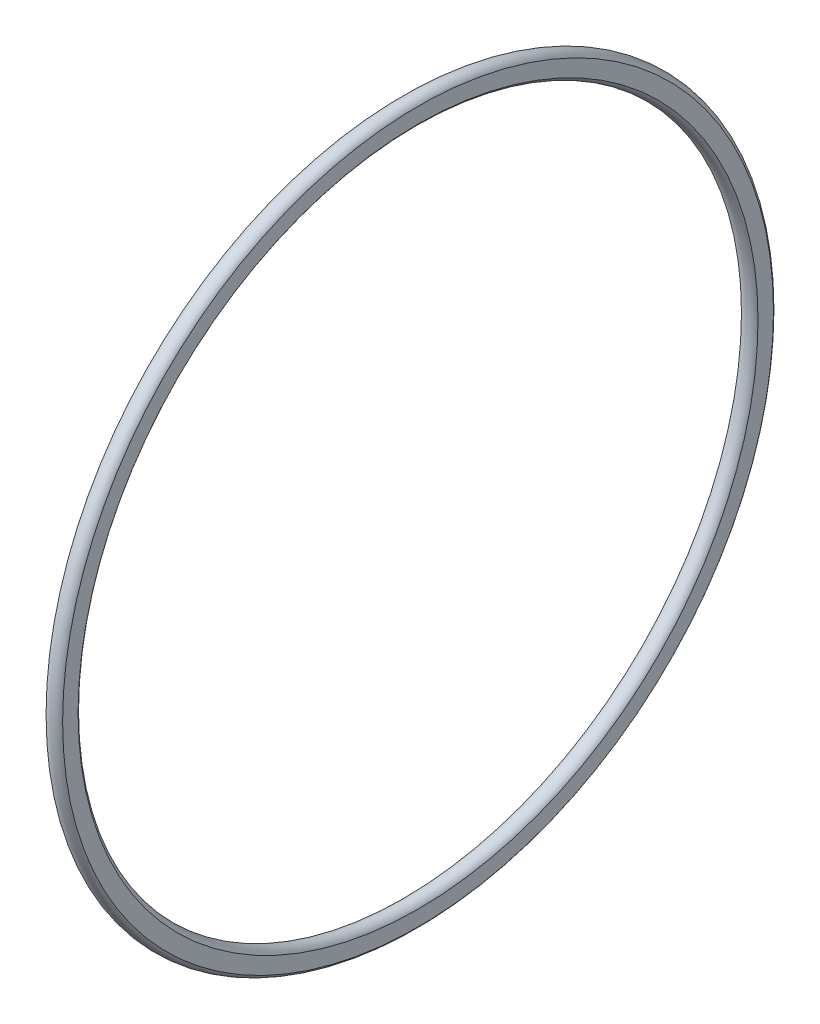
ISO-10303-21;
HEADER;
FILE_DESCRIPTION(('STEP AP214'),'2;1');
FILE_NAME('part.step','',(''),(''),'','','');
FILE_SCHEMA(('AUTOMOTIVE_DESIGN { 1 0 10303 214 1 1 1 1 }'));
ENDSEC;
DATA;
#1=APPLICATION_CONTEXT('core data for automotive mechanical design processes');
#2=APPLICATION_PROTOCOL_DEFINITION('international standard','automotive_design',2000,#1);
#3=PRODUCT_CONTEXT('',#1,'mechanical');
#4=PRODUCT('Part','Part','',(#3));
#5=PRODUCT_RELATED_PRODUCT_CATEGORY('part','',(#4));
#6=PRODUCT_DEFINITION_FORMATION('','',#4);
#7=PRODUCT_DEFINITION_CONTEXT('part definition',#1,'design');
#8=PRODUCT_DEFINITION('design','',#6,#7);
#9=PRODUCT_DEFINITION_SHAPE('','',#8);
#10=(LENGTH_UNIT() NAMED_UNIT(*) SI_UNIT(.MILLI.,.METRE.));
#11=(NAMED_UNIT(*) PLANE_ANGLE_UNIT() SI_UNIT($,.RADIAN.));
#12=(NAMED_UNIT(*) SI_UNIT($,.STERADIAN.) SOLID_ANGLE_UNIT());
#13=UNCERTAINTY_MEASURE_WITH_UNIT(LENGTH_MEASURE(1.E-05),#10,'distance_accuracy_value','');
#14=(GEOMETRIC_REPRESENTATION_CONTEXT(3) GLOBAL_UNCERTAINTY_ASSIGNED_CONTEXT((#13)) GLOBAL_UNIT_ASSIGNED_CONTEXT((#10,
#11,#12)) REPRESENTATION_CONTEXT('',''));
#15=CARTESIAN_POINT('',(0.,0.,0.));
#16=DIRECTION('',(0.,0.,1.));
#17=DIRECTION('',(1.,0.,0.));
#18=AXIS2_PLACEMENT_3D('',#15,#16,#17);
#19=CARTESIAN_POINT('',(-0.990599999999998,0.,0.));
#20=DIRECTION('',(1.,0.,0.));
#21=DIRECTION('',(0.,0.,-1.));
#22=AXIS2_PLACEMENT_3D('',#19,#20,#21);
#23=TOROIDAL_SURFACE('',#22,42.3799,1.143);
#24=CARTESIAN_POINT('',(0.,0.,0.));
#25=DIRECTION('',(1.,0.,0.));
#26=DIRECTION('',(0.,0.,-1.));
#27=AXIS2_PLACEMENT_3D('',#24,#25,#26);
#28=CIRCLE('',#27,41.8096714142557);
#29=CARTESIAN_POINT('',(0.,0.,-41.8096714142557));
#30=VERTEX_POINT('',#29);
#31=EDGE_CURVE('E10',#30,#30,#28,.T.);
#32=ORIENTED_EDGE('',*,*,#31,.T.);
#33=EDGE_LOOP('',(#32));
#34=FACE_BOUND('',#33,.T.);
#35=CARTESIAN_POINT('',(-1.9812,0.,0.));
#36=DIRECTION('',(1.,0.,0.));
#37=DIRECTION('',(0.,0.,-1.));
#38=AXIS2_PLACEMENT_3D('',#35,#36,#37);
#39=CIRCLE('',#38,41.8096714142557);
#40=CARTESIAN_POINT('',(-1.9812,0.,-41.8096714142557));
#41=VERTEX_POINT('',#40);
#42=EDGE_CURVE('E392',#41,#41,#39,.T.);
#43=ORIENTED_EDGE('',*,*,#42,.F.);
#44=EDGE_LOOP('',(#43));
#45=FACE_BOUND('',#44,.T.);
#46=ADVANCED_FACE('F378',(#34,#45),#23,.T.);
#47=CARTESIAN_POINT('',(0.,41.8096714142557,0.));
#48=DIRECTION('',(1.,0.,0.));
#49=DIRECTION('',(0.,0.,-1.));
#50=AXIS2_PLACEMENT_3D('',#47,#48,#49);
#51=PLANE('',#50);
#52=CARTESIAN_POINT('',(0.,0.,0.));
#53=DIRECTION('',(1.,0.,0.));
#54=DIRECTION('',(0.,0.,-1.));
#55=AXIS2_PLACEMENT_3D('',#52,#53,#54);
#56=CIRCLE('',#55,43.7121285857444);
#57=CARTESIAN_POINT('',(0.,0.,-43.7121285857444));
#58=VERTEX_POINT('',#57);
#59=EDGE_CURVE('E384',#58,#58,#56,.T.);
#60=ORIENTED_EDGE('',*,*,#59,.T.);
#61=EDGE_LOOP('',(#60));
#62=FACE_BOUND('',#61,.T.);
#63=ORIENTED_EDGE('',*,*,#31,.F.);
#64=EDGE_LOOP('',(#63));
#65=FACE_BOUND('',#64,.T.);
#66=ADVANCED_FACE('F402',(#62,#65),#51,.T.);
#67=CARTESIAN_POINT('',(-0.990599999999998,0.,0.));
#68=DIRECTION('',(1.,0.,0.));
#69=DIRECTION('',(0.,0.,-1.));
#70=AXIS2_PLACEMENT_3D('',#67,#68,#69);
#71=TOROIDAL_SURFACE('',#70,43.1419,1.14300000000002);
#72=CARTESIAN_POINT('',(-1.9812,0.,0.));
#73=DIRECTION('',(1.,0.,0.));
#74=DIRECTION('',(0.,0.,-1.));
#75=AXIS2_PLACEMENT_3D('',#72,#73,#74);
#76=CIRCLE('',#75,43.7121285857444);
#77=CARTESIAN_POINT('',(-1.9812,0.,-43.7121285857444));
#78=VERTEX_POINT('',#77);
#79=EDGE_CURVE('E388',#78,#78,#76,.T.);
#80=ORIENTED_EDGE('',*,*,#79,.T.);
#81=EDGE_LOOP('',(#80));
#82=FACE_BOUND('',#81,.T.);
#83=ORIENTED_EDGE('',*,*,#59,.F.);
#84=EDGE_LOOP('',(#83));
#85=FACE_BOUND('',#84,.T.);
#86=ADVANCED_FACE('F406',(#82,#85),#71,.T.);
#87=CARTESIAN_POINT('',(-1.9812,43.7121285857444,0.));
#88=DIRECTION('',(-1.,0.,0.));
#89=DIRECTION('',(0.,0.,1.));
#90=AXIS2_PLACEMENT_3D('',#87,#88,#89);
#91=PLANE('',#90);
#92=ORIENTED_EDGE('',*,*,#42,.T.);
#93=EDGE_LOOP('',(#92));
#94=FACE_BOUND('',#93,.T.);
#95=ORIENTED_EDGE('',*,*,#79,.F.);
#96=EDGE_LOOP('',(#95));
#97=FACE_BOUND('',#96,.T.);
#98=ADVANCED_FACE('F398',(#94,#97),#91,.T.);
#99=CLOSED_SHELL('',(#46,#66,#86,#98));
#100=MANIFOLD_SOLID_BREP('B2',#99);
#101=ADVANCED_BREP_SHAPE_REPRESENTATION('',(#18,#100),#14);
#102=SHAPE_DEFINITION_REPRESENTATION(#9,#101);
ENDSEC;
END-ISO-10303-21;
